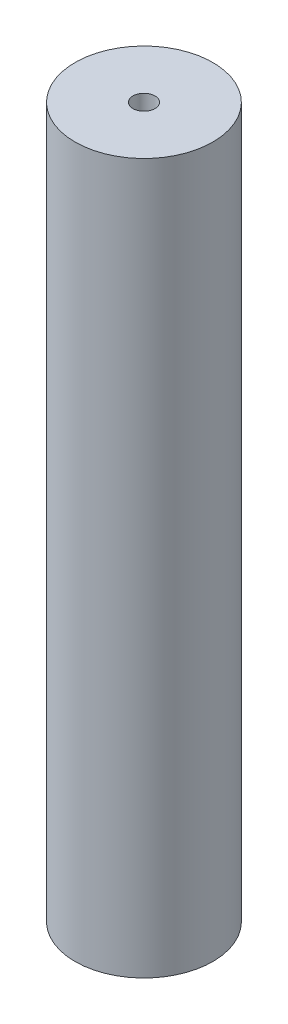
ISO-10303-21;
HEADER;
FILE_DESCRIPTION(('STEP AP214'),'2;1');
FILE_NAME('part.step','',(''),(''),'','','');
FILE_SCHEMA(('AUTOMOTIVE_DESIGN { 1 0 10303 214 1 1 1 1 }'));
ENDSEC;
DATA;
#1=APPLICATION_CONTEXT('core data for automotive mechanical design processes');
#2=APPLICATION_PROTOCOL_DEFINITION('international standard','automotive_design',2000,#1);
#3=PRODUCT_CONTEXT('',#1,'mechanical');
#4=PRODUCT('Part','Part','',(#3));
#5=PRODUCT_RELATED_PRODUCT_CATEGORY('part','',(#4));
#6=PRODUCT_DEFINITION_FORMATION('','',#4);
#7=PRODUCT_DEFINITION_CONTEXT('part definition',#1,'design');
#8=PRODUCT_DEFINITION('design','',#6,#7);
#9=PRODUCT_DEFINITION_SHAPE('','',#8);
#10=(LENGTH_UNIT() NAMED_UNIT(*) SI_UNIT(.MILLI.,.METRE.));
#11=(NAMED_UNIT(*) PLANE_ANGLE_UNIT() SI_UNIT($,.RADIAN.));
#12=(NAMED_UNIT(*) SI_UNIT($,.STERADIAN.) SOLID_ANGLE_UNIT());
#13=UNCERTAINTY_MEASURE_WITH_UNIT(LENGTH_MEASURE(1.E-05),#10,'distance_accuracy_value','');
#14=(GEOMETRIC_REPRESENTATION_CONTEXT(3) GLOBAL_UNCERTAINTY_ASSIGNED_CONTEXT((#13)) GLOBAL_UNIT_ASSIGNED_CONTEXT((#10,
#11,#12)) REPRESENTATION_CONTEXT('',''));
#15=CARTESIAN_POINT('',(0.,0.,0.));
#16=DIRECTION('',(0.,0.,1.));
#17=DIRECTION('',(1.,0.,0.));
#18=AXIS2_PLACEMENT_3D('',#15,#16,#17);
#19=CARTESIAN_POINT('',(-285.,138.284271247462,120.));
#20=DIRECTION('',(0.,-1.,0.));
#21=DIRECTION('',(0.,0.,-1.));
#22=AXIS2_PLACEMENT_3D('',#19,#20,#21);
#23=CYLINDRICAL_SURFACE('',#22,9.99999999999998);
#24=CARTESIAN_POINT('',(-285.,7.00000000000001,120.));
#25=DIRECTION('',(0.,1.,0.));
#26=DIRECTION('',(0.,0.,1.));
#27=AXIS2_PLACEMENT_3D('',#24,#25,#26);
#28=CIRCLE('',#27,9.99999999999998);
#29=CARTESIAN_POINT('',(-285.,7.00000000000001,130.));
#30=VERTEX_POINT('',#29);
#31=EDGE_CURVE('E47',#30,#30,#28,.T.);
#32=ORIENTED_EDGE('',*,*,#31,.T.);
#33=EDGE_LOOP('',(#32));
#34=FACE_BOUND('',#33,.T.);
#35=CARTESIAN_POINT('',(-285.,110.,120.));
#36=DIRECTION('',(0.,1.,0.));
#37=DIRECTION('',(0.,0.,1.));
#38=AXIS2_PLACEMENT_3D('',#35,#36,#37);
#39=CIRCLE('',#38,9.99999999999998);
#40=CARTESIAN_POINT('',(-285.,110.,130.));
#41=VERTEX_POINT('',#40);
#42=EDGE_CURVE('E12',#41,#41,#39,.T.);
#43=ORIENTED_EDGE('',*,*,#42,.F.);
#44=EDGE_LOOP('',(#43));
#45=FACE_BOUND('',#44,.T.);
#46=ADVANCED_FACE('F38',(#34,#45),#23,.T.);
#47=CARTESIAN_POINT('',(-285.,7.,120.));
#48=DIRECTION('',(0.,1.,0.));
#49=DIRECTION('',(0.,0.,1.));
#50=AXIS2_PLACEMENT_3D('',#47,#48,#49);
#51=PLANE('',#50);
#52=CARTESIAN_POINT('',(-285.,7.,120.));
#53=DIRECTION('',(0.,1.,0.));
#54=DIRECTION('',(0.,0.,1.));
#55=AXIS2_PLACEMENT_3D('',#52,#53,#54);
#56=CIRCLE('',#55,1.59999999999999);
#57=CARTESIAN_POINT('',(-285.,7.,121.6));
#58=VERTEX_POINT('',#57);
#59=EDGE_CURVE('E68',#58,#58,#56,.T.);
#60=ORIENTED_EDGE('',*,*,#59,.T.);
#61=EDGE_LOOP('',(#60));
#62=FACE_BOUND('',#61,.T.);
#63=ORIENTED_EDGE('',*,*,#31,.F.);
#64=EDGE_LOOP('',(#63));
#65=FACE_BOUND('',#64,.T.);
#66=ADVANCED_FACE('F85',(#62,#65),#51,.F.);
#67=CARTESIAN_POINT('',(0.,110.,0.));
#68=DIRECTION('',(0.,1.,0.));
#69=DIRECTION('',(0.,0.,1.));
#70=AXIS2_PLACEMENT_3D('',#67,#68,#69);
#71=PLANE('',#70);
#72=CARTESIAN_POINT('',(-285.,110.,120.));
#73=DIRECTION('',(0.,1.,0.));
#74=DIRECTION('',(0.,0.,1.));
#75=AXIS2_PLACEMENT_3D('',#72,#73,#74);
#76=CIRCLE('',#75,1.59999999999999);
#77=CARTESIAN_POINT('',(-285.,110.,121.6));
#78=VERTEX_POINT('',#77);
#79=EDGE_CURVE('E62',#78,#78,#76,.T.);
#80=ORIENTED_EDGE('',*,*,#79,.F.);
#81=EDGE_LOOP('',(#80));
#82=FACE_BOUND('',#81,.T.);
#83=ORIENTED_EDGE('',*,*,#42,.T.);
#84=EDGE_LOOP('',(#83));
#85=FACE_BOUND('',#84,.T.);
#86=ADVANCED_FACE('F79',(#82,#85),#71,.T.);
#87=CARTESIAN_POINT('',(-285.,0.,120.));
#88=DIRECTION('',(0.,-1.,0.));
#89=DIRECTION('',(0.,0.,-1.));
#90=AXIS2_PLACEMENT_3D('',#87,#88,#89);
#91=CYLINDRICAL_SURFACE('',#90,1.59999999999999);
#92=CARTESIAN_POINT('',(-285.,21.1666333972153,120.));
#93=DIRECTION('',(0.,-1.,0.));
#94=DIRECTION('',(0.,0.,-1.));
#95=AXIS2_PLACEMENT_3D('',#92,#93,#94);
#96=CIRCLE('',#95,1.59999999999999);
#97=CARTESIAN_POINT('',(-285.,21.1666333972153,118.4));
#98=VERTEX_POINT('',#97);
#99=EDGE_CURVE('E42',#98,#98,#96,.T.);
#100=ORIENTED_EDGE('',*,*,#99,.F.);
#101=EDGE_LOOP('',(#100));
#102=FACE_BOUND('',#101,.T.);
#103=ORIENTED_EDGE('',*,*,#59,.F.);
#104=EDGE_LOOP('',(#103));
#105=FACE_BOUND('',#104,.T.);
#106=ADVANCED_FACE('F76',(#102,#105),#91,.F.);
#107=CARTESIAN_POINT('',(-285.,20.8571673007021,120.));
#108=DIRECTION('',(0.,-1.,0.));
#109=DIRECTION('',(0.,0.,-1.));
#110=AXIS2_PLACEMENT_3D('',#107,#108,#109);
#111=CONICAL_SURFACE('',#110,2.11503807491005,1.02974425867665);
#112=CARTESIAN_POINT('',(-285.,22.1280103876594,120.));
#113=VERTEX_POINT('',#112);
#114=VERTEX_LOOP('',#113);
#115=FACE_BOUND('',#114,.T.);
#116=ORIENTED_EDGE('',*,*,#99,.T.);
#117=EDGE_LOOP('',(#116));
#118=FACE_BOUND('',#117,.T.);
#119=ADVANCED_FACE('F40',(#115,#118),#111,.F.);
#120=CARTESIAN_POINT('',(-285.,98.1428326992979,120.));
#121=DIRECTION('',(0.,1.,0.));
#122=DIRECTION('',(0.,0.,1.));
#123=AXIS2_PLACEMENT_3D('',#120,#121,#122);
#124=CONICAL_SURFACE('',#123,2.11503807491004,1.02974425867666);
#125=CARTESIAN_POINT('',(-285.,96.8719896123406,120.));
#126=VERTEX_POINT('',#125);
#127=VERTEX_LOOP('',#126);
#128=FACE_BOUND('',#127,.T.);
#129=CARTESIAN_POINT('',(-285.,97.8333666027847,120.));
#130=DIRECTION('',(0.,1.,0.));
#131=DIRECTION('',(0.,0.,1.));
#132=AXIS2_PLACEMENT_3D('',#129,#130,#131);
#133=CIRCLE('',#132,1.59999999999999);
#134=CARTESIAN_POINT('',(-285.,97.8333666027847,121.6));
#135=VERTEX_POINT('',#134);
#136=EDGE_CURVE('E60',#135,#135,#133,.T.);
#137=ORIENTED_EDGE('',*,*,#136,.T.);
#138=EDGE_LOOP('',(#137));
#139=FACE_BOUND('',#138,.T.);
#140=ADVANCED_FACE('F54',(#128,#139),#124,.F.);
#141=CARTESIAN_POINT('',(-285.,119.,120.));
#142=DIRECTION('',(0.,1.,0.));
#143=DIRECTION('',(0.,0.,1.));
#144=AXIS2_PLACEMENT_3D('',#141,#142,#143);
#145=CYLINDRICAL_SURFACE('',#144,1.59999999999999);
#146=ORIENTED_EDGE('',*,*,#79,.T.);
#147=EDGE_LOOP('',(#146));
#148=FACE_BOUND('',#147,.T.);
#149=ORIENTED_EDGE('',*,*,#136,.F.);
#150=EDGE_LOOP('',(#149));
#151=FACE_BOUND('',#150,.T.);
#152=ADVANCED_FACE('F57',(#148,#151),#145,.F.);
#153=CLOSED_SHELL('',(#46,#66,#86,#106,#119,#140,#152));
#154=MANIFOLD_SOLID_BREP('B2',#153);
#155=ADVANCED_BREP_SHAPE_REPRESENTATION('',(#18,#154),#14);
#156=SHAPE_DEFINITION_REPRESENTATION(#9,#155);
ENDSEC;
END-ISO-10303-21;
